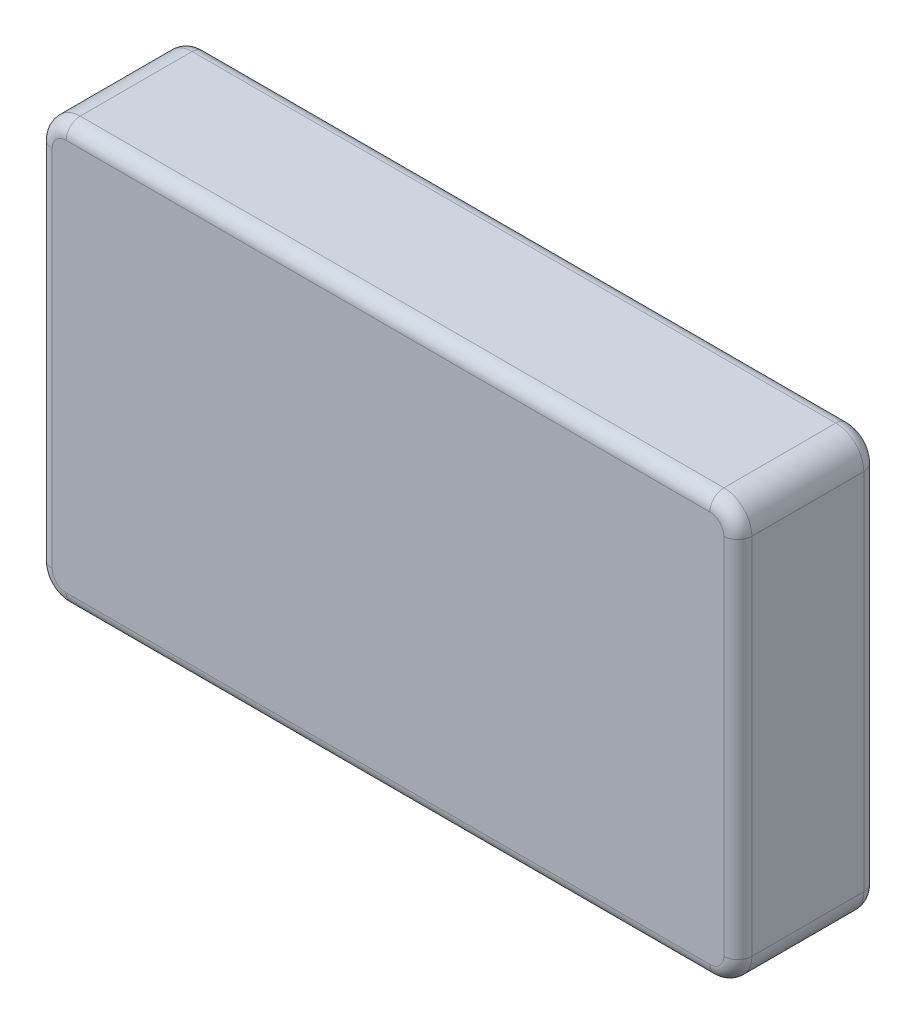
ISO-10303-21;
HEADER;
FILE_DESCRIPTION(('STEP AP214'),'2;1');
FILE_NAME('part.step','',(''),(''),'','','');
FILE_SCHEMA(('AUTOMOTIVE_DESIGN { 1 0 10303 214 1 1 1 1 }'));
ENDSEC;
DATA;
#1=APPLICATION_CONTEXT('core data for automotive mechanical design processes');
#2=APPLICATION_PROTOCOL_DEFINITION('international standard','automotive_design',2000,#1);
#3=PRODUCT_CONTEXT('',#1,'mechanical');
#4=PRODUCT('Part','Part','',(#3));
#5=PRODUCT_RELATED_PRODUCT_CATEGORY('part','',(#4));
#6=PRODUCT_DEFINITION_FORMATION('','',#4);
#7=PRODUCT_DEFINITION_CONTEXT('part definition',#1,'design');
#8=PRODUCT_DEFINITION('design','',#6,#7);
#9=PRODUCT_DEFINITION_SHAPE('','',#8);
#10=(LENGTH_UNIT() NAMED_UNIT(*) SI_UNIT(.MILLI.,.METRE.));
#11=(NAMED_UNIT(*) PLANE_ANGLE_UNIT() SI_UNIT($,.RADIAN.));
#12=(NAMED_UNIT(*) SI_UNIT($,.STERADIAN.) SOLID_ANGLE_UNIT());
#13=UNCERTAINTY_MEASURE_WITH_UNIT(LENGTH_MEASURE(1.E-05),#10,'distance_accuracy_value','');
#14=(GEOMETRIC_REPRESENTATION_CONTEXT(3) GLOBAL_UNCERTAINTY_ASSIGNED_CONTEXT((#13)) GLOBAL_UNIT_ASSIGNED_CONTEXT((#10,
#11,#12)) REPRESENTATION_CONTEXT('',''));
#15=CARTESIAN_POINT('',(0.,0.,0.));
#16=DIRECTION('',(0.,0.,1.));
#17=DIRECTION('',(1.,0.,0.));
#18=AXIS2_PLACEMENT_3D('',#15,#16,#17);
#19=CARTESIAN_POINT('',(-21.0962406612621,27.2786123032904,12.7));
#20=DIRECTION('',(1.,0.,0.));
#21=DIRECTION('',(0.,1.,0.));
#22=AXIS2_PLACEMENT_3D('',#19,#20,#21);
#23=PLANE('',#22);
#24=DIRECTION('',(0.,0.,-1.));
#25=VECTOR('',#24,1.);
#26=CARTESIAN_POINT('',(-21.0962406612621,-8.28138769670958,12.7));
#27=LINE('',#26,#25);
#28=CARTESIAN_POINT('',(-21.0962406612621,-8.28138769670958,1.27));
#29=VERTEX_POINT('',#28);
#30=CARTESIAN_POINT('',(-21.0962406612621,-8.28138769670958,11.43));
#31=VERTEX_POINT('',#30);
#32=EDGE_CURVE('E289',#29,#31,#27,.F.);
#33=ORIENTED_EDGE('',*,*,#32,.T.);
#34=DIRECTION('',(0.,-1.,0.));
#35=VECTOR('',#34,1.);
#36=CARTESIAN_POINT('',(-21.0962406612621,24.7386123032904,11.43));
#37=LINE('',#36,#35);
#38=CARTESIAN_POINT('',(-21.0962406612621,24.7386123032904,11.43));
#39=VERTEX_POINT('',#38);
#40=EDGE_CURVE('E197',#31,#39,#37,.F.);
#41=ORIENTED_EDGE('',*,*,#40,.T.);
#42=DIRECTION('',(0.,0.,-1.));
#43=VECTOR('',#42,1.);
#44=CARTESIAN_POINT('',(-21.0962406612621,24.7386123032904,12.7));
#45=LINE('',#44,#43);
#46=CARTESIAN_POINT('',(-21.0962406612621,24.7386123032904,1.27));
#47=VERTEX_POINT('',#46);
#48=EDGE_CURVE('E287',#39,#47,#45,.T.);
#49=ORIENTED_EDGE('',*,*,#48,.T.);
#50=DIRECTION('',(0.,-1.,0.));
#51=VECTOR('',#50,1.);
#52=CARTESIAN_POINT('',(-21.0962406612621,27.2786123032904,1.27));
#53=LINE('',#52,#51);
#54=EDGE_CURVE('E195',#47,#29,#53,.T.);
#55=ORIENTED_EDGE('',*,*,#54,.T.);
#56=EDGE_LOOP('',(#33,#41,#49,#55));
#57=FACE_BOUND('',#56,.T.);
#58=ADVANCED_FACE('F31',(#57),#23,.F.);
#59=CARTESIAN_POINT('',(-21.0962406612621,-10.8213876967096,12.7));
#60=DIRECTION('',(0.,1.,0.));
#61=DIRECTION('',(0.,0.,1.));
#62=AXIS2_PLACEMENT_3D('',#59,#60,#61);
#63=PLANE('',#62);
#64=DIRECTION('',(0.,0.,-1.));
#65=VECTOR('',#64,1.);
#66=CARTESIAN_POINT('',(-18.5562406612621,-10.8213876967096,12.7));
#67=LINE('',#66,#65);
#68=CARTESIAN_POINT('',(-18.5562406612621,-10.8213876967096,11.43));
#69=VERTEX_POINT('',#68);
#70=CARTESIAN_POINT('',(-18.5562406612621,-10.8213876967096,1.27));
#71=VERTEX_POINT('',#70);
#72=EDGE_CURVE('E284',#69,#71,#67,.T.);
#73=ORIENTED_EDGE('',*,*,#72,.T.);
#74=DIRECTION('',(1.,0.,0.));
#75=VECTOR('',#74,1.);
#76=CARTESIAN_POINT('',(-21.0962406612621,-10.8213876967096,1.27));
#77=LINE('',#76,#75);
#78=CARTESIAN_POINT('',(39.8637593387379,-10.8213876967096,1.27));
#79=VERTEX_POINT('',#78);
#80=EDGE_CURVE('E219',#71,#79,#77,.T.);
#81=ORIENTED_EDGE('',*,*,#80,.T.);
#82=DIRECTION('',(0.,0.,-1.));
#83=VECTOR('',#82,1.);
#84=CARTESIAN_POINT('',(39.8637593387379,-10.8213876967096,12.7));
#85=LINE('',#84,#83);
#86=CARTESIAN_POINT('',(39.8637593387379,-10.8213876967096,11.43));
#87=VERTEX_POINT('',#86);
#88=EDGE_CURVE('E281',#79,#87,#85,.F.);
#89=ORIENTED_EDGE('',*,*,#88,.T.);
#90=DIRECTION('',(1.,0.,0.));
#91=VECTOR('',#90,1.);
#92=CARTESIAN_POINT('',(-18.5562406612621,-10.8213876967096,11.43));
#93=LINE('',#92,#91);
#94=EDGE_CURVE('E217',#87,#69,#93,.F.);
#95=ORIENTED_EDGE('',*,*,#94,.T.);
#96=EDGE_LOOP('',(#73,#81,#89,#95));
#97=FACE_BOUND('',#96,.T.);
#98=ADVANCED_FACE('F334',(#97),#63,.F.);
#99=CARTESIAN_POINT('',(42.4037593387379,27.2786123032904,12.7));
#100=DIRECTION('',(-1.,0.,0.));
#101=DIRECTION('',(0.,0.,1.));
#102=AXIS2_PLACEMENT_3D('',#99,#100,#101);
#103=PLANE('',#102);
#104=DIRECTION('',(0.,0.,-1.));
#105=VECTOR('',#104,1.);
#106=CARTESIAN_POINT('',(42.4037593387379,24.7386123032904,12.7));
#107=LINE('',#106,#105);
#108=CARTESIAN_POINT('',(42.4037593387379,24.7386123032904,1.27));
#109=VERTEX_POINT('',#108);
#110=CARTESIAN_POINT('',(42.4037593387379,24.7386123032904,11.43));
#111=VERTEX_POINT('',#110);
#112=EDGE_CURVE('E292',#109,#111,#107,.F.);
#113=ORIENTED_EDGE('',*,*,#112,.T.);
#114=DIRECTION('',(0.,1.,0.));
#115=VECTOR('',#114,1.);
#116=CARTESIAN_POINT('',(42.4037593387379,-8.28138769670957,11.43));
#117=LINE('',#116,#115);
#118=CARTESIAN_POINT('',(42.4037593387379,-8.28138769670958,11.43));
#119=VERTEX_POINT('',#118);
#120=EDGE_CURVE('E185',#111,#119,#117,.F.);
#121=ORIENTED_EDGE('',*,*,#120,.T.);
#122=DIRECTION('',(0.,0.,-1.));
#123=VECTOR('',#122,1.);
#124=CARTESIAN_POINT('',(42.4037593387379,-8.28138769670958,12.7));
#125=LINE('',#124,#123);
#126=CARTESIAN_POINT('',(42.4037593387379,-8.28138769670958,1.27));
#127=VERTEX_POINT('',#126);
#128=EDGE_CURVE('E295',#119,#127,#125,.T.);
#129=ORIENTED_EDGE('',*,*,#128,.T.);
#130=DIRECTION('',(0.,1.,0.));
#131=VECTOR('',#130,1.);
#132=CARTESIAN_POINT('',(42.4037593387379,27.2786123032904,1.27));
#133=LINE('',#132,#131);
#134=EDGE_CURVE('E183',#127,#109,#133,.T.);
#135=ORIENTED_EDGE('',*,*,#134,.T.);
#136=EDGE_LOOP('',(#113,#121,#129,#135));
#137=FACE_BOUND('',#136,.T.);
#138=ADVANCED_FACE('F353',(#137),#103,.F.);
#139=CARTESIAN_POINT('',(-21.0962406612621,27.2786123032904,12.7));
#140=DIRECTION('',(0.,-1.,0.));
#141=DIRECTION('',(0.,0.,-1.));
#142=AXIS2_PLACEMENT_3D('',#139,#140,#141);
#143=PLANE('',#142);
#144=DIRECTION('',(0.,0.,-1.));
#145=VECTOR('',#144,1.);
#146=CARTESIAN_POINT('',(-18.5562406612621,27.2786123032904,12.7));
#147=LINE('',#146,#145);
#148=CARTESIAN_POINT('',(-18.5562406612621,27.2786123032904,1.27));
#149=VERTEX_POINT('',#148);
#150=CARTESIAN_POINT('',(-18.5562406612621,27.2786123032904,11.43));
#151=VERTEX_POINT('',#150);
#152=EDGE_CURVE('E162',#149,#151,#147,.F.);
#153=ORIENTED_EDGE('',*,*,#152,.T.);
#154=DIRECTION('',(-1.,0.,0.));
#155=VECTOR('',#154,1.);
#156=CARTESIAN_POINT('',(39.8637593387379,27.2786123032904,11.43));
#157=LINE('',#156,#155);
#158=CARTESIAN_POINT('',(39.8637593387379,27.2786123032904,11.43));
#159=VERTEX_POINT('',#158);
#160=EDGE_CURVE('E11',#151,#159,#157,.F.);
#161=ORIENTED_EDGE('',*,*,#160,.T.);
#162=DIRECTION('',(0.,0.,-1.));
#163=VECTOR('',#162,1.);
#164=CARTESIAN_POINT('',(39.8637593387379,27.2786123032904,12.7));
#165=LINE('',#164,#163);
#166=CARTESIAN_POINT('',(39.8637593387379,27.2786123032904,1.27));
#167=VERTEX_POINT('',#166);
#168=EDGE_CURVE('E227',#159,#167,#165,.T.);
#169=ORIENTED_EDGE('',*,*,#168,.T.);
#170=DIRECTION('',(-1.,0.,0.));
#171=VECTOR('',#170,1.);
#172=CARTESIAN_POINT('',(-21.0962406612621,27.2786123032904,1.27));
#173=LINE('',#172,#171);
#174=EDGE_CURVE('E38',#167,#149,#173,.T.);
#175=ORIENTED_EDGE('',*,*,#174,.T.);
#176=EDGE_LOOP('',(#153,#161,#169,#175));
#177=FACE_BOUND('',#176,.T.);
#178=ADVANCED_FACE('F225',(#177),#143,.F.);
#179=CARTESIAN_POINT('',(-21.0962406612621,-10.8213876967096,12.7));
#180=DIRECTION('',(0.,0.,1.));
#181=DIRECTION('',(1.,0.,0.));
#182=AXIS2_PLACEMENT_3D('',#179,#180,#181);
#183=PLANE('',#182);
#184=CARTESIAN_POINT('',(39.8637593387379,-8.28138769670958,12.7));
#185=DIRECTION('',(0.,0.,1.));
#186=DIRECTION('',(1.,0.,0.));
#187=AXIS2_PLACEMENT_3D('',#184,#185,#186);
#188=CIRCLE('',#187,1.27);
#189=CARTESIAN_POINT('',(39.8637593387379,-9.55138769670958,12.7));
#190=VERTEX_POINT('',#189);
#191=CARTESIAN_POINT('',(41.1337593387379,-8.28138769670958,12.7));
#192=VERTEX_POINT('',#191);
#193=EDGE_CURVE('E171',#190,#192,#188,.T.);
#194=ORIENTED_EDGE('',*,*,#193,.T.);
#195=DIRECTION('',(0.,1.,0.));
#196=VECTOR('',#195,1.);
#197=CARTESIAN_POINT('',(41.1337593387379,24.7386123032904,12.7));
#198=LINE('',#197,#196);
#199=CARTESIAN_POINT('',(41.1337593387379,24.7386123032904,12.7));
#200=VERTEX_POINT('',#199);
#201=EDGE_CURVE('E166',#192,#200,#198,.T.);
#202=ORIENTED_EDGE('',*,*,#201,.T.);
#203=CARTESIAN_POINT('',(39.8637593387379,24.7386123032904,12.7));
#204=DIRECTION('',(0.,0.,1.));
#205=DIRECTION('',(1.,0.,0.));
#206=AXIS2_PLACEMENT_3D('',#203,#204,#205);
#207=CIRCLE('',#206,1.27);
#208=CARTESIAN_POINT('',(39.8637593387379,26.0086123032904,12.7));
#209=VERTEX_POINT('',#208);
#210=EDGE_CURVE('E146',#200,#209,#207,.T.);
#211=ORIENTED_EDGE('',*,*,#210,.T.);
#212=DIRECTION('',(-1.,0.,0.));
#213=VECTOR('',#212,1.);
#214=CARTESIAN_POINT('',(-18.5562406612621,26.0086123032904,12.7));
#215=LINE('',#214,#213);
#216=CARTESIAN_POINT('',(-18.5562406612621,26.0086123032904,12.7));
#217=VERTEX_POINT('',#216);
#218=EDGE_CURVE('E155',#209,#217,#215,.T.);
#219=ORIENTED_EDGE('',*,*,#218,.T.);
#220=CARTESIAN_POINT('',(-18.5562406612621,24.7386123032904,12.7));
#221=DIRECTION('',(0.,0.,1.));
#222=DIRECTION('',(1.,0.,0.));
#223=AXIS2_PLACEMENT_3D('',#220,#221,#222);
#224=CIRCLE('',#223,1.27);
#225=CARTESIAN_POINT('',(-19.8262406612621,24.7386123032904,12.7));
#226=VERTEX_POINT('',#225);
#227=EDGE_CURVE('E161',#217,#226,#224,.T.);
#228=ORIENTED_EDGE('',*,*,#227,.T.);
#229=DIRECTION('',(0.,-1.,0.));
#230=VECTOR('',#229,1.);
#231=CARTESIAN_POINT('',(-19.8262406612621,-8.28138769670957,12.7));
#232=LINE('',#231,#230);
#233=CARTESIAN_POINT('',(-19.8262406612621,-8.28138769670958,12.7));
#234=VERTEX_POINT('',#233);
#235=EDGE_CURVE('E173',#226,#234,#232,.T.);
#236=ORIENTED_EDGE('',*,*,#235,.T.);
#237=CARTESIAN_POINT('',(-18.5562406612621,-8.28138769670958,12.7));
#238=DIRECTION('',(0.,0.,1.));
#239=DIRECTION('',(1.,0.,0.));
#240=AXIS2_PLACEMENT_3D('',#237,#238,#239);
#241=CIRCLE('',#240,1.27);
#242=CARTESIAN_POINT('',(-18.5562406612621,-9.55138769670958,12.7));
#243=VERTEX_POINT('',#242);
#244=EDGE_CURVE('E169',#234,#243,#241,.T.);
#245=ORIENTED_EDGE('',*,*,#244,.T.);
#246=DIRECTION('',(1.,0.,0.));
#247=VECTOR('',#246,1.);
#248=CARTESIAN_POINT('',(39.8637593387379,-9.55138769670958,12.7));
#249=LINE('',#248,#247);
#250=EDGE_CURVE('E168',#243,#190,#249,.T.);
#251=ORIENTED_EDGE('',*,*,#250,.T.);
#252=EDGE_LOOP('',(#194,#202,#211,#219,#228,#236,#245,#251));
#253=FACE_BOUND('',#252,.T.);
#254=ADVANCED_FACE('F164',(#253),#183,.T.);
#255=CARTESIAN_POINT('',(-21.0962406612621,-10.8213876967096,0.));
#256=DIRECTION('',(0.,0.,1.));
#257=DIRECTION('',(1.,0.,0.));
#258=AXIS2_PLACEMENT_3D('',#255,#256,#257);
#259=PLANE('',#258);
#260=CARTESIAN_POINT('',(39.8637593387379,24.7386123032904,0.));
#261=DIRECTION('',(0.,0.,1.));
#262=DIRECTION('',(1.,0.,0.));
#263=AXIS2_PLACEMENT_3D('',#260,#261,#262);
#264=CIRCLE('',#263,1.27);
#265=CARTESIAN_POINT('',(39.8637593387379,26.0086123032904,0.));
#266=VERTEX_POINT('',#265);
#267=CARTESIAN_POINT('',(41.1337593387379,24.7386123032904,0.));
#268=VERTEX_POINT('',#267);
#269=EDGE_CURVE('E211',#266,#268,#264,.F.);
#270=ORIENTED_EDGE('',*,*,#269,.T.);
#271=DIRECTION('',(0.,1.,0.));
#272=VECTOR('',#271,1.);
#273=CARTESIAN_POINT('',(41.1337593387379,-10.8213876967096,0.));
#274=LINE('',#273,#272);
#275=CARTESIAN_POINT('',(41.1337593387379,-8.28138769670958,0.));
#276=VERTEX_POINT('',#275);
#277=EDGE_CURVE('E45',#268,#276,#274,.F.);
#278=ORIENTED_EDGE('',*,*,#277,.T.);
#279=CARTESIAN_POINT('',(39.8637593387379,-8.28138769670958,0.));
#280=DIRECTION('',(0.,0.,1.));
#281=DIRECTION('',(1.,0.,0.));
#282=AXIS2_PLACEMENT_3D('',#279,#280,#281);
#283=CIRCLE('',#282,1.27);
#284=CARTESIAN_POINT('',(39.8637593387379,-9.55138769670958,0.));
#285=VERTEX_POINT('',#284);
#286=EDGE_CURVE('E49',#276,#285,#283,.F.);
#287=ORIENTED_EDGE('',*,*,#286,.T.);
#288=DIRECTION('',(1.,0.,0.));
#289=VECTOR('',#288,1.);
#290=CARTESIAN_POINT('',(-21.0962406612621,-9.55138769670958,0.));
#291=LINE('',#290,#289);
#292=CARTESIAN_POINT('',(-18.5562406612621,-9.55138769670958,0.));
#293=VERTEX_POINT('',#292);
#294=EDGE_CURVE('E213',#285,#293,#291,.F.);
#295=ORIENTED_EDGE('',*,*,#294,.T.);
#296=CARTESIAN_POINT('',(-18.5562406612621,-8.28138769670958,0.));
#297=DIRECTION('',(0.,0.,1.));
#298=DIRECTION('',(1.,0.,0.));
#299=AXIS2_PLACEMENT_3D('',#296,#297,#298);
#300=CIRCLE('',#299,1.27);
#301=CARTESIAN_POINT('',(-19.8262406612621,-8.28138769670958,0.));
#302=VERTEX_POINT('',#301);
#303=EDGE_CURVE('E209',#293,#302,#300,.F.);
#304=ORIENTED_EDGE('',*,*,#303,.T.);
#305=DIRECTION('',(0.,-1.,0.));
#306=VECTOR('',#305,1.);
#307=CARTESIAN_POINT('',(-19.8262406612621,-10.8213876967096,0.));
#308=LINE('',#307,#306);
#309=CARTESIAN_POINT('',(-19.8262406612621,24.7386123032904,0.));
#310=VERTEX_POINT('',#309);
#311=EDGE_CURVE('E207',#302,#310,#308,.F.);
#312=ORIENTED_EDGE('',*,*,#311,.T.);
#313=CARTESIAN_POINT('',(-18.5562406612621,24.7386123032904,0.));
#314=DIRECTION('',(0.,0.,1.));
#315=DIRECTION('',(1.,0.,0.));
#316=AXIS2_PLACEMENT_3D('',#313,#314,#315);
#317=CIRCLE('',#316,1.27);
#318=CARTESIAN_POINT('',(-18.5562406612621,26.0086123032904,0.));
#319=VERTEX_POINT('',#318);
#320=EDGE_CURVE('E205',#310,#319,#317,.F.);
#321=ORIENTED_EDGE('',*,*,#320,.T.);
#322=DIRECTION('',(-1.,0.,0.));
#323=VECTOR('',#322,1.);
#324=CARTESIAN_POINT('',(-21.0962406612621,26.0086123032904,0.));
#325=LINE('',#324,#323);
#326=EDGE_CURVE('E203',#319,#266,#325,.F.);
#327=ORIENTED_EDGE('',*,*,#326,.T.);
#328=EDGE_LOOP('',(#270,#278,#287,#295,#304,#312,#321,#327));
#329=FACE_BOUND('',#328,.T.);
#330=ADVANCED_FACE('F327',(#329),#259,.F.);
#331=CARTESIAN_POINT('',(-18.5562406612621,-8.28138769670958,12.7));
#332=DIRECTION('',(0.,0.,-1.));
#333=DIRECTION('',(-1.,0.,0.));
#334=AXIS2_PLACEMENT_3D('',#331,#332,#333);
#335=CYLINDRICAL_SURFACE('',#334,2.54);
#336=ORIENTED_EDGE('',*,*,#72,.F.);
#337=CARTESIAN_POINT('',(-18.5562406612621,-8.28138769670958,11.43));
#338=DIRECTION('',(0.,0.,1.));
#339=DIRECTION('',(1.,0.,0.));
#340=AXIS2_PLACEMENT_3D('',#337,#338,#339);
#341=CIRCLE('',#340,2.54);
#342=EDGE_CURVE('E193',#69,#31,#341,.F.);
#343=ORIENTED_EDGE('',*,*,#342,.T.);
#344=ORIENTED_EDGE('',*,*,#32,.F.);
#345=CARTESIAN_POINT('',(-18.5562406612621,-8.28138769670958,1.27));
#346=DIRECTION('',(0.,0.,1.));
#347=DIRECTION('',(1.,0.,0.));
#348=AXIS2_PLACEMENT_3D('',#345,#346,#347);
#349=CIRCLE('',#348,2.54);
#350=EDGE_CURVE('E191',#29,#71,#349,.T.);
#351=ORIENTED_EDGE('',*,*,#350,.T.);
#352=EDGE_LOOP('',(#336,#343,#344,#351));
#353=FACE_BOUND('',#352,.T.);
#354=ADVANCED_FACE('F317',(#353),#335,.T.);
#355=CARTESIAN_POINT('',(39.8637593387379,-8.28138769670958,12.7));
#356=DIRECTION('',(0.,0.,-1.));
#357=DIRECTION('',(-1.,0.,0.));
#358=AXIS2_PLACEMENT_3D('',#355,#356,#357);
#359=CYLINDRICAL_SURFACE('',#358,2.54);
#360=ORIENTED_EDGE('',*,*,#128,.F.);
#361=CARTESIAN_POINT('',(39.8637593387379,-8.28138769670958,11.43));
#362=DIRECTION('',(0.,0.,1.));
#363=DIRECTION('',(1.,0.,0.));
#364=AXIS2_PLACEMENT_3D('',#361,#362,#363);
#365=CIRCLE('',#364,2.54);
#366=EDGE_CURVE('E189',#119,#87,#365,.F.);
#367=ORIENTED_EDGE('',*,*,#366,.T.);
#368=ORIENTED_EDGE('',*,*,#88,.F.);
#369=CARTESIAN_POINT('',(39.8637593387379,-8.28138769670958,1.27));
#370=DIRECTION('',(0.,0.,1.));
#371=DIRECTION('',(1.,0.,0.));
#372=AXIS2_PLACEMENT_3D('',#369,#370,#371);
#373=CIRCLE('',#372,2.54);
#374=EDGE_CURVE('E187',#79,#127,#373,.T.);
#375=ORIENTED_EDGE('',*,*,#374,.T.);
#376=EDGE_LOOP('',(#360,#367,#368,#375));
#377=FACE_BOUND('',#376,.T.);
#378=ADVANCED_FACE('F338',(#377),#359,.T.);
#379=CARTESIAN_POINT('',(-18.5562406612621,24.7386123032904,12.7));
#380=DIRECTION('',(0.,0.,-1.));
#381=DIRECTION('',(-1.,0.,0.));
#382=AXIS2_PLACEMENT_3D('',#379,#380,#381);
#383=CYLINDRICAL_SURFACE('',#382,2.54);
#384=ORIENTED_EDGE('',*,*,#48,.F.);
#385=CARTESIAN_POINT('',(-18.5562406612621,24.7386123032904,11.43));
#386=DIRECTION('',(0.,0.,1.));
#387=DIRECTION('',(1.,0.,0.));
#388=AXIS2_PLACEMENT_3D('',#385,#386,#387);
#389=CIRCLE('',#388,2.54);
#390=EDGE_CURVE('E201',#39,#151,#389,.F.);
#391=ORIENTED_EDGE('',*,*,#390,.T.);
#392=ORIENTED_EDGE('',*,*,#152,.F.);
#393=CARTESIAN_POINT('',(-18.5562406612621,24.7386123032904,1.27));
#394=DIRECTION('',(0.,0.,1.));
#395=DIRECTION('',(1.,0.,0.));
#396=AXIS2_PLACEMENT_3D('',#393,#394,#395);
#397=CIRCLE('',#396,2.54);
#398=EDGE_CURVE('E199',#149,#47,#397,.T.);
#399=ORIENTED_EDGE('',*,*,#398,.T.);
#400=EDGE_LOOP('',(#384,#391,#392,#399));
#401=FACE_BOUND('',#400,.T.);
#402=ADVANCED_FACE('F234',(#401),#383,.T.);
#403=CARTESIAN_POINT('',(39.8637593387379,24.7386123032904,12.7));
#404=DIRECTION('',(0.,0.,-1.));
#405=DIRECTION('',(-1.,0.,0.));
#406=AXIS2_PLACEMENT_3D('',#403,#404,#405);
#407=CYLINDRICAL_SURFACE('',#406,2.54);
#408=ORIENTED_EDGE('',*,*,#168,.F.);
#409=CARTESIAN_POINT('',(39.8637593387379,24.7386123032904,11.43));
#410=DIRECTION('',(0.,0.,1.));
#411=DIRECTION('',(1.,0.,0.));
#412=AXIS2_PLACEMENT_3D('',#409,#410,#411);
#413=CIRCLE('',#412,2.54);
#414=EDGE_CURVE('E148',#159,#111,#413,.F.);
#415=ORIENTED_EDGE('',*,*,#414,.T.);
#416=ORIENTED_EDGE('',*,*,#112,.F.);
#417=CARTESIAN_POINT('',(39.8637593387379,24.7386123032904,1.27));
#418=DIRECTION('',(0.,0.,1.));
#419=DIRECTION('',(1.,0.,0.));
#420=AXIS2_PLACEMENT_3D('',#417,#418,#419);
#421=CIRCLE('',#420,2.54);
#422=EDGE_CURVE('E179',#109,#167,#421,.T.);
#423=ORIENTED_EDGE('',*,*,#422,.T.);
#424=EDGE_LOOP('',(#408,#415,#416,#423));
#425=FACE_BOUND('',#424,.T.);
#426=ADVANCED_FACE('F351',(#425),#407,.T.);
#427=CARTESIAN_POINT('',(-18.5562406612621,-8.28138769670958,11.43));
#428=DIRECTION('',(0.,0.,1.));
#429=DIRECTION('',(1.,0.,0.));
#430=AXIS2_PLACEMENT_3D('',#427,#428,#429);
#431=DEGENERATE_TOROIDAL_SURFACE('',#430,1.27,1.27,.T.);
#432=CARTESIAN_POINT('',(-19.8262406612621,-8.28138769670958,11.43));
#433=DIRECTION('',(0.,1.,0.));
#434=DIRECTION('',(0.,0.,1.));
#435=AXIS2_PLACEMENT_3D('',#432,#433,#434);
#436=CIRCLE('',#435,1.27);
#437=EDGE_CURVE('E275',#31,#234,#436,.T.);
#438=ORIENTED_EDGE('',*,*,#437,.F.);
#439=ORIENTED_EDGE('',*,*,#342,.F.);
#440=CARTESIAN_POINT('',(-18.5562406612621,-9.55138769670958,11.43));
#441=DIRECTION('',(1.,0.,0.));
#442=DIRECTION('',(0.,0.,-1.));
#443=AXIS2_PLACEMENT_3D('',#440,#441,#442);
#444=CIRCLE('',#443,1.27);
#445=EDGE_CURVE('E278',#243,#69,#444,.T.);
#446=ORIENTED_EDGE('',*,*,#445,.F.);
#447=ORIENTED_EDGE('',*,*,#244,.F.);
#448=EDGE_LOOP('',(#438,#439,#446,#447));
#449=FACE_BOUND('',#448,.T.);
#450=ADVANCED_FACE('F306',(#449),#431,.T.);
#451=CARTESIAN_POINT('',(-21.0962406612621,-9.55138769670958,11.43));
#452=DIRECTION('',(-1.,0.,0.));
#453=DIRECTION('',(0.,0.,1.));
#454=AXIS2_PLACEMENT_3D('',#451,#452,#453);
#455=CYLINDRICAL_SURFACE('',#454,1.27);
#456=ORIENTED_EDGE('',*,*,#445,.T.);
#457=ORIENTED_EDGE('',*,*,#94,.F.);
#458=CARTESIAN_POINT('',(39.8637593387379,-9.55138769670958,11.43));
#459=DIRECTION('',(1.,0.,0.));
#460=DIRECTION('',(0.,0.,-1.));
#461=AXIS2_PLACEMENT_3D('',#458,#459,#460);
#462=CIRCLE('',#461,1.27);
#463=EDGE_CURVE('E272',#190,#87,#462,.T.);
#464=ORIENTED_EDGE('',*,*,#463,.F.);
#465=ORIENTED_EDGE('',*,*,#250,.F.);
#466=EDGE_LOOP('',(#456,#457,#464,#465));
#467=FACE_BOUND('',#466,.T.);
#468=ADVANCED_FACE('F395',(#467),#455,.T.);
#469=CARTESIAN_POINT('',(-19.8262406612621,-10.8213876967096,11.43));
#470=DIRECTION('',(0.,1.,0.));
#471=DIRECTION('',(-1.,0.,0.));
#472=AXIS2_PLACEMENT_3D('',#469,#470,#471);
#473=CYLINDRICAL_SURFACE('',#472,1.27);
#474=ORIENTED_EDGE('',*,*,#437,.T.);
#475=ORIENTED_EDGE('',*,*,#235,.F.);
#476=CARTESIAN_POINT('',(-19.8262406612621,24.7386123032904,11.43));
#477=DIRECTION('',(0.,1.,0.));
#478=DIRECTION('',(0.,0.,1.));
#479=AXIS2_PLACEMENT_3D('',#476,#477,#478);
#480=CIRCLE('',#479,1.27);
#481=EDGE_CURVE('E269',#39,#226,#480,.T.);
#482=ORIENTED_EDGE('',*,*,#481,.F.);
#483=ORIENTED_EDGE('',*,*,#40,.F.);
#484=EDGE_LOOP('',(#474,#475,#482,#483));
#485=FACE_BOUND('',#484,.T.);
#486=ADVANCED_FACE('F310',(#485),#473,.T.);
#487=CARTESIAN_POINT('',(39.8637593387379,-8.28138769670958,11.43));
#488=DIRECTION('',(0.,0.,1.));
#489=DIRECTION('',(1.,0.,0.));
#490=AXIS2_PLACEMENT_3D('',#487,#488,#489);
#491=DEGENERATE_TOROIDAL_SURFACE('',#490,1.27,1.27,.T.);
#492=ORIENTED_EDGE('',*,*,#463,.T.);
#493=ORIENTED_EDGE('',*,*,#366,.F.);
#494=CARTESIAN_POINT('',(41.1337593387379,-8.28138769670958,11.43));
#495=DIRECTION('',(0.,1.,0.));
#496=DIRECTION('',(0.,0.,1.));
#497=AXIS2_PLACEMENT_3D('',#494,#495,#496);
#498=CIRCLE('',#497,1.27);
#499=EDGE_CURVE('E266',#192,#119,#498,.T.);
#500=ORIENTED_EDGE('',*,*,#499,.F.);
#501=ORIENTED_EDGE('',*,*,#193,.F.);
#502=EDGE_LOOP('',(#492,#493,#500,#501));
#503=FACE_BOUND('',#502,.T.);
#504=ADVANCED_FACE('F342',(#503),#491,.T.);
#505=CARTESIAN_POINT('',(-18.5562406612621,24.7386123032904,11.43));
#506=DIRECTION('',(0.,0.,1.));
#507=DIRECTION('',(1.,0.,0.));
#508=AXIS2_PLACEMENT_3D('',#505,#506,#507);
#509=DEGENERATE_TOROIDAL_SURFACE('',#508,1.27,1.27,.T.);
#510=ORIENTED_EDGE('',*,*,#481,.T.);
#511=ORIENTED_EDGE('',*,*,#227,.F.);
#512=CARTESIAN_POINT('',(-18.5562406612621,26.0086123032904,11.43));
#513=DIRECTION('',(1.,0.,0.));
#514=DIRECTION('',(0.,0.,-1.));
#515=AXIS2_PLACEMENT_3D('',#512,#513,#514);
#516=CIRCLE('',#515,1.27);
#517=EDGE_CURVE('E158',#151,#217,#516,.T.);
#518=ORIENTED_EDGE('',*,*,#517,.F.);
#519=ORIENTED_EDGE('',*,*,#390,.F.);
#520=EDGE_LOOP('',(#510,#511,#518,#519));
#521=FACE_BOUND('',#520,.T.);
#522=ADVANCED_FACE('F403',(#521),#509,.T.);
#523=CARTESIAN_POINT('',(41.1337593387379,-10.8213876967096,11.43));
#524=DIRECTION('',(0.,-1.,0.));
#525=DIRECTION('',(0.,0.,-1.));
#526=AXIS2_PLACEMENT_3D('',#523,#524,#525);
#527=CYLINDRICAL_SURFACE('',#526,1.27);
#528=ORIENTED_EDGE('',*,*,#499,.T.);
#529=ORIENTED_EDGE('',*,*,#120,.F.);
#530=CARTESIAN_POINT('',(41.1337593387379,24.7386123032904,11.43));
#531=DIRECTION('',(0.,1.,0.));
#532=DIRECTION('',(0.,0.,1.));
#533=AXIS2_PLACEMENT_3D('',#530,#531,#532);
#534=CIRCLE('',#533,1.27);
#535=EDGE_CURVE('E151',#200,#111,#534,.T.);
#536=ORIENTED_EDGE('',*,*,#535,.F.);
#537=ORIENTED_EDGE('',*,*,#201,.F.);
#538=EDGE_LOOP('',(#528,#529,#536,#537));
#539=FACE_BOUND('',#538,.T.);
#540=ADVANCED_FACE('F347',(#539),#527,.T.);
#541=CARTESIAN_POINT('',(-21.0962406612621,26.0086123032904,11.43));
#542=DIRECTION('',(1.,0.,0.));
#543=DIRECTION('',(0.,0.,-1.));
#544=AXIS2_PLACEMENT_3D('',#541,#542,#543);
#545=CYLINDRICAL_SURFACE('',#544,1.27);
#546=ORIENTED_EDGE('',*,*,#517,.T.);
#547=ORIENTED_EDGE('',*,*,#218,.F.);
#548=CARTESIAN_POINT('',(39.8637593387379,26.0086123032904,11.43));
#549=DIRECTION('',(1.,0.,0.));
#550=DIRECTION('',(0.,0.,-1.));
#551=AXIS2_PLACEMENT_3D('',#548,#549,#550);
#552=CIRCLE('',#551,1.27);
#553=EDGE_CURVE('E142',#159,#209,#552,.T.);
#554=ORIENTED_EDGE('',*,*,#553,.F.);
#555=ORIENTED_EDGE('',*,*,#160,.F.);
#556=EDGE_LOOP('',(#546,#547,#554,#555));
#557=FACE_BOUND('',#556,.T.);
#558=ADVANCED_FACE('F156',(#557),#545,.T.);
#559=CARTESIAN_POINT('',(39.8637593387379,24.7386123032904,11.43));
#560=DIRECTION('',(0.,0.,1.));
#561=DIRECTION('',(1.,0.,0.));
#562=AXIS2_PLACEMENT_3D('',#559,#560,#561);
#563=DEGENERATE_TOROIDAL_SURFACE('',#562,1.27,1.27,.T.);
#564=ORIENTED_EDGE('',*,*,#535,.T.);
#565=ORIENTED_EDGE('',*,*,#414,.F.);
#566=ORIENTED_EDGE('',*,*,#553,.T.);
#567=ORIENTED_EDGE('',*,*,#210,.F.);
#568=EDGE_LOOP('',(#564,#565,#566,#567));
#569=FACE_BOUND('',#568,.T.);
#570=ADVANCED_FACE('F144',(#569),#563,.T.);
#571=CARTESIAN_POINT('',(-18.5562406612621,-8.28138769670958,1.27));
#572=DIRECTION('',(0.,0.,1.));
#573=DIRECTION('',(1.,0.,0.));
#574=AXIS2_PLACEMENT_3D('',#571,#572,#573);
#575=DEGENERATE_TOROIDAL_SURFACE('',#574,1.27,1.27,.T.);
#576=CARTESIAN_POINT('',(-18.5562406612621,-9.55138769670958,1.27));
#577=DIRECTION('',(1.,0.,0.));
#578=DIRECTION('',(0.,0.,-1.));
#579=AXIS2_PLACEMENT_3D('',#576,#577,#578);
#580=CIRCLE('',#579,1.27);
#581=EDGE_CURVE('E259',#71,#293,#580,.T.);
#582=ORIENTED_EDGE('',*,*,#581,.F.);
#583=ORIENTED_EDGE('',*,*,#350,.F.);
#584=CARTESIAN_POINT('',(-19.8262406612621,-8.28138769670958,1.27));
#585=DIRECTION('',(0.,1.,0.));
#586=DIRECTION('',(0.,0.,1.));
#587=AXIS2_PLACEMENT_3D('',#584,#585,#586);
#588=CIRCLE('',#587,1.27);
#589=EDGE_CURVE('E152',#302,#29,#588,.T.);
#590=ORIENTED_EDGE('',*,*,#589,.F.);
#591=ORIENTED_EDGE('',*,*,#303,.F.);
#592=EDGE_LOOP('',(#582,#583,#590,#591));
#593=FACE_BOUND('',#592,.T.);
#594=ADVANCED_FACE('F321',(#593),#575,.T.);
#595=CARTESIAN_POINT('',(-19.8262406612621,27.2786123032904,1.27));
#596=DIRECTION('',(0.,-1.,0.));
#597=DIRECTION('',(1.,0.,0.));
#598=AXIS2_PLACEMENT_3D('',#595,#596,#597);
#599=CYLINDRICAL_SURFACE('',#598,1.27);
#600=ORIENTED_EDGE('',*,*,#589,.T.);
#601=ORIENTED_EDGE('',*,*,#54,.F.);
#602=CARTESIAN_POINT('',(-19.8262406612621,24.7386123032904,1.27));
#603=DIRECTION('',(0.,1.,0.));
#604=DIRECTION('',(0.,0.,1.));
#605=AXIS2_PLACEMENT_3D('',#602,#603,#604);
#606=CIRCLE('',#605,1.27);
#607=EDGE_CURVE('E246',#310,#47,#606,.T.);
#608=ORIENTED_EDGE('',*,*,#607,.F.);
#609=ORIENTED_EDGE('',*,*,#311,.F.);
#610=EDGE_LOOP('',(#600,#601,#608,#609));
#611=FACE_BOUND('',#610,.T.);
#612=ADVANCED_FACE('F326',(#611),#599,.T.);
#613=CARTESIAN_POINT('',(-21.0962406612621,-9.55138769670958,1.27));
#614=DIRECTION('',(1.,0.,0.));
#615=DIRECTION('',(0.,0.,-1.));
#616=AXIS2_PLACEMENT_3D('',#613,#614,#615);
#617=CYLINDRICAL_SURFACE('',#616,1.27);
#618=ORIENTED_EDGE('',*,*,#581,.T.);
#619=ORIENTED_EDGE('',*,*,#294,.F.);
#620=CARTESIAN_POINT('',(39.8637593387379,-9.55138769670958,1.27));
#621=DIRECTION('',(1.,0.,0.));
#622=DIRECTION('',(0.,0.,-1.));
#623=AXIS2_PLACEMENT_3D('',#620,#621,#622);
#624=CIRCLE('',#623,1.27);
#625=EDGE_CURVE('E248',#79,#285,#624,.T.);
#626=ORIENTED_EDGE('',*,*,#625,.F.);
#627=ORIENTED_EDGE('',*,*,#80,.F.);
#628=EDGE_LOOP('',(#618,#619,#626,#627));
#629=FACE_BOUND('',#628,.T.);
#630=ADVANCED_FACE('F329',(#629),#617,.T.);
#631=CARTESIAN_POINT('',(-18.5562406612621,24.7386123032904,1.27));
#632=DIRECTION('',(0.,0.,1.));
#633=DIRECTION('',(1.,0.,0.));
#634=AXIS2_PLACEMENT_3D('',#631,#632,#633);
#635=DEGENERATE_TOROIDAL_SURFACE('',#634,1.27,1.27,.T.);
#636=ORIENTED_EDGE('',*,*,#607,.T.);
#637=ORIENTED_EDGE('',*,*,#398,.F.);
#638=CARTESIAN_POINT('',(-18.5562406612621,26.0086123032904,1.27));
#639=DIRECTION('',(1.,0.,0.));
#640=DIRECTION('',(0.,0.,-1.));
#641=AXIS2_PLACEMENT_3D('',#638,#639,#640);
#642=CIRCLE('',#641,1.27);
#643=EDGE_CURVE('E243',#319,#149,#642,.T.);
#644=ORIENTED_EDGE('',*,*,#643,.F.);
#645=ORIENTED_EDGE('',*,*,#320,.F.);
#646=EDGE_LOOP('',(#636,#637,#644,#645));
#647=FACE_BOUND('',#646,.T.);
#648=ADVANCED_FACE('F241',(#647),#635,.T.);
#649=CARTESIAN_POINT('',(39.8637593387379,-8.28138769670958,1.27));
#650=DIRECTION('',(0.,0.,1.));
#651=DIRECTION('',(1.,0.,0.));
#652=AXIS2_PLACEMENT_3D('',#649,#650,#651);
#653=DEGENERATE_TOROIDAL_SURFACE('',#652,1.27,1.27,.T.);
#654=ORIENTED_EDGE('',*,*,#625,.T.);
#655=ORIENTED_EDGE('',*,*,#286,.F.);
#656=CARTESIAN_POINT('',(41.1337593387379,-8.28138769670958,1.27));
#657=DIRECTION('',(0.,1.,0.));
#658=DIRECTION('',(0.,0.,1.));
#659=AXIS2_PLACEMENT_3D('',#656,#657,#658);
#660=CIRCLE('',#659,1.27);
#661=EDGE_CURVE('E249',#127,#276,#660,.T.);
#662=ORIENTED_EDGE('',*,*,#661,.F.);
#663=ORIENTED_EDGE('',*,*,#374,.F.);
#664=EDGE_LOOP('',(#654,#655,#662,#663));
#665=FACE_BOUND('',#664,.T.);
#666=ADVANCED_FACE('F421',(#665),#653,.T.);
#667=CARTESIAN_POINT('',(-21.0962406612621,26.0086123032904,1.27));
#668=DIRECTION('',(-1.,0.,0.));
#669=DIRECTION('',(0.,0.,1.));
#670=AXIS2_PLACEMENT_3D('',#667,#668,#669);
#671=CYLINDRICAL_SURFACE('',#670,1.27);
#672=ORIENTED_EDGE('',*,*,#643,.T.);
#673=ORIENTED_EDGE('',*,*,#174,.F.);
#674=CARTESIAN_POINT('',(39.8637593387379,26.0086123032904,1.27));
#675=DIRECTION('',(1.,0.,0.));
#676=DIRECTION('',(0.,0.,-1.));
#677=AXIS2_PLACEMENT_3D('',#674,#675,#676);
#678=CIRCLE('',#677,1.27);
#679=EDGE_CURVE('E254',#266,#167,#678,.T.);
#680=ORIENTED_EDGE('',*,*,#679,.F.);
#681=ORIENTED_EDGE('',*,*,#326,.F.);
#682=EDGE_LOOP('',(#672,#673,#680,#681));
#683=FACE_BOUND('',#682,.T.);
#684=ADVANCED_FACE('F247',(#683),#671,.T.);
#685=CARTESIAN_POINT('',(41.1337593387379,27.2786123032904,1.27));
#686=DIRECTION('',(0.,1.,0.));
#687=DIRECTION('',(0.,0.,1.));
#688=AXIS2_PLACEMENT_3D('',#685,#686,#687);
#689=CYLINDRICAL_SURFACE('',#688,1.27);
#690=ORIENTED_EDGE('',*,*,#661,.T.);
#691=ORIENTED_EDGE('',*,*,#277,.F.);
#692=CARTESIAN_POINT('',(41.1337593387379,24.7386123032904,1.27));
#693=DIRECTION('',(0.,1.,0.));
#694=DIRECTION('',(0.,0.,1.));
#695=AXIS2_PLACEMENT_3D('',#692,#693,#694);
#696=CIRCLE('',#695,1.27);
#697=EDGE_CURVE('E359',#109,#268,#696,.T.);
#698=ORIENTED_EDGE('',*,*,#697,.F.);
#699=ORIENTED_EDGE('',*,*,#134,.F.);
#700=EDGE_LOOP('',(#690,#691,#698,#699));
#701=FACE_BOUND('',#700,.T.);
#702=ADVANCED_FACE('F358',(#701),#689,.T.);
#703=CARTESIAN_POINT('',(39.8637593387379,24.7386123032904,1.27));
#704=DIRECTION('',(0.,0.,1.));
#705=DIRECTION('',(1.,0.,0.));
#706=AXIS2_PLACEMENT_3D('',#703,#704,#705);
#707=DEGENERATE_TOROIDAL_SURFACE('',#706,1.27,1.27,.T.);
#708=ORIENTED_EDGE('',*,*,#679,.T.);
#709=ORIENTED_EDGE('',*,*,#422,.F.);
#710=ORIENTED_EDGE('',*,*,#697,.T.);
#711=ORIENTED_EDGE('',*,*,#269,.F.);
#712=EDGE_LOOP('',(#708,#709,#710,#711));
#713=FACE_BOUND('',#712,.T.);
#714=ADVANCED_FACE('F363',(#713),#707,.T.);
#715=CLOSED_SHELL('',(#58,#98,#138,#178,#254,#330,#354,#378,#402,#426,#450,#468,#486,#504,#522,
#540,#558,#570,#594,#612,#630,#648,#666,#684,#702,#714));
#716=MANIFOLD_SOLID_BREP('B2',#715);
#717=ADVANCED_BREP_SHAPE_REPRESENTATION('',(#18,#716),#14);
#718=SHAPE_DEFINITION_REPRESENTATION(#9,#717);
ENDSEC;
END-ISO-10303-21;
